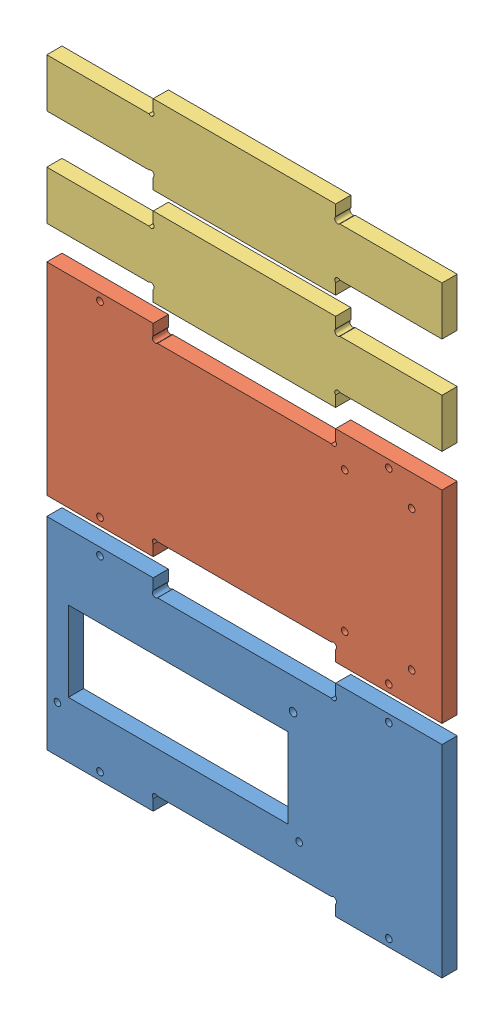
SolidWorks assembly Assemblage1.sldasm, configuration Défaut (file format 7000). Lengths in mm.
Overall size (130 203 5).
4 component instances, 3 part files, 9 mates.
Components (placement in the parent):
- cache OLED 2 lignes-1: cache OLED 2 lignes.SLDPRT [Défaut] at (-75.354 -21.0194 127.5) size (130 66.5 5)
- support OLED 2 lignes-1: support OLED 2 lignes.SLDPRT [Défaut] at (-75.354 51.4806 127.5) size (130 66.5 5)
- plaque-1: plaque.SLDPRT [Défaut] at (-75.354 123.9806 127.5) size (130 26 5)
- plaque-2: plaque.SLDPRT [Défaut] at (-75.354 155.9806 127.5) size (130 26 5)
Mates (geometry in assembly coordinates):
- Coïncidente1: coincident aligned: plane of cache OLED 2 lignes-1 through (-75.354 45.4806 127.5) normal (0 0 -1); plane of support OLED 2 lignes-1 through (-75.354 117.9806 127.5) normal (0 0 -1)
- Coïncidente2: coincident aligned: plane of support OLED 2 lignes-1 through (-75.354 117.9806 127.5) normal (0 0 -1); plane of plaque-1 through (-75.354 149.9806 127.5) normal (0 0 -1)
- Coïncidente3: coincident aligned: plane of cache OLED 2 lignes-1 through (-75.354 45.4806 127.5) normal (0 0 -1); plane of plaque-2 through (-75.354 181.9806 127.5) normal (0 0 -1)
- Coïncidente4: coincident aligned: plane of cache OLED 2 lignes-1 through (54.646 -21.0194 132.5) normal (1 0 0); plane of support OLED 2 lignes-1 through (54.646 51.4806 132.5) normal (1 0 0)
- Coïncidente5: coincident aligned: plane of cache OLED 2 lignes-1 through (54.646 -21.0194 132.5) normal (1 0 0); plane of plaque-1 through (54.646 123.9806 132.5) normal (1 0 0)
- Coïncidente6: coincident aligned: plane of cache OLED 2 lignes-1 through (54.646 -21.0194 132.5) normal (1 0 0); plane of plaque-2 through (54.646 155.9806 132.5) normal (1 0 0)
- Distance1: distance = 6 mm anti-aligned: plane of cache OLED 2 lignes-1 through (-75.354 45.4806 132.5) normal (0 1 0); plane of support OLED 2 lignes-1 through (-75.354 51.4806 132.5) normal (0 -1 0)
- Distance2: distance = 6 mm anti-aligned: plane of support OLED 2 lignes-1 through (-75.354 117.9806 132.5) normal (0 1 0); plane of plaque-1 through (-75.354 123.9806 132.5) normal (0 -1 0)
- Distance3: distance = 6 mm anti-aligned: plane of plaque-2 through (-75.354 155.9806 132.5) normal (0 -1 0); plane of plaque-1 through (-75.354 149.9806 132.5) normal (0 1 0)
